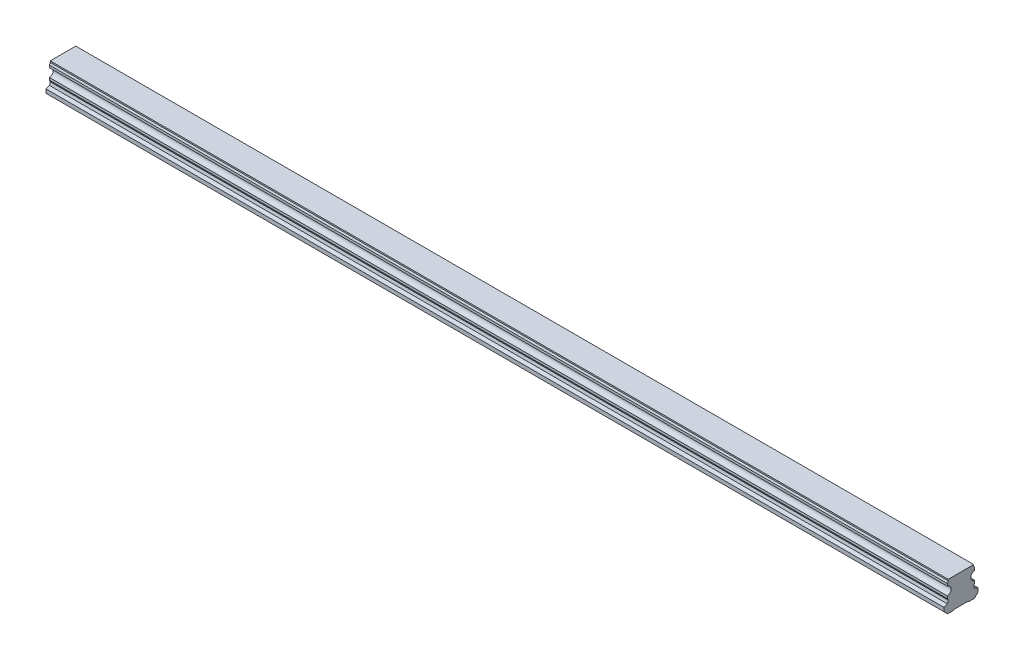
from build123d import *

# Parameters (mm, degrees)
BOSS_EXTRUDE1_DEPTH        = 660
SKETCH3_R                  = 3
SKETCH3_R_2                = 2.5
CUT_EXTRUDE3_DEPTH         = 12
SKETCH3_2_R                = 2.5
CUT_EXTRUDE4_DEPTH         = 15
CHAMFER1_SIZE              = 0.5
LPATTERN4_COUNT            = 11
LPATTERN4_PITCH            = 60
CHAMFER1_OF_LPATTERN4_SIZE = 0.5


with BuildPart() as part:
    # Sketch1 → Boss-Extrude1 (new body)
    with BuildSketch(Plane(origin=(0, 0, 0), x_dir=(0, 0, -1), z_dir=(1, 0, 0))):
        with BuildLine():
            Line((9.375, 21.8), (-9.375, 21.8))
            Line((-9.375, 21.8), (-9.375, 20.756))
            Line((-9.375, 20.756), (-10, 19.415683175))
            Line((-10, 19.415683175), (-10, 17.685449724))
            ThreePointArc((-10, 17.685449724), (-7.2, 14.6), (-10, 11.514550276))
            Line((-10, 11.514550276), (-10, 9.784316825))
            Line((-10, 9.784316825), (-9.375, 8.444))
            Line((-9.375, 8.444), (-9.922688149, 6.4))
            Line((-9.922688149, 6.4), (-12.5, 5.489338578))
            Line((-12.5, 5.489338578), (-12.5, 2.65))
            Line((-12.5, 2.65), (-9.85, 0))
            Line((-9.85, 0), (-5.5, 0))
            Line((-5.5, 0), (-5, 0.5))
            Line((-5, 0.5), (5, 0.5))
            Line((5, 0.5), (5.5, 0))
            Line((5.5, 0), (9.85, 0))
            Line((9.85, 0), (12.5, 2.65))
            Line((12.5, 2.65), (12.5, 5.489338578))
            Line((12.5, 5.489338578), (9.922688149, 6.4))
            Line((9.922688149, 6.4), (9.375, 8.444))
            Line((9.375, 8.444), (10, 9.784316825))
            Line((10, 9.784316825), (10, 11.514550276))
            ThreePointArc((10, 11.514550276), (7.2, 14.6), (10, 17.685449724))
            Line((10, 17.685449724), (10, 19.415683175))
            Line((10, 19.415683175), (9.375, 20.756))
            Line((9.375, 20.756), (9.375, 21.8))
        make_face()
    extrude(amount=BOSS_EXTRUDE1_DEPTH)

    # Sketch3 → Cut-Extrude3 (cut)
    with BuildSketch(Plane.XZ):
        with Locations(Location((30, 0, 0), (0, 0, 270))):
            Circle(SKETCH3_R)
        with Locations(Location((30, 0, 0), (0, 0, 270))):
            Circle(SKETCH3_R_2, mode=Mode.SUBTRACT)
    cut_extrude3 = extrude(amount=-CUT_EXTRUDE3_DEPTH, mode=Mode.SUBTRACT)

    # Sketch3_2 → Cut-Extrude4 (cut)
    with BuildSketch(Plane.XZ):
        with Locations(Location((30, 0, 0), (0, 0, 270))):
            Circle(SKETCH3_2_R)
    cut_extrude4 = extrude(amount=-CUT_EXTRUDE4_DEPTH, mode=Mode.SUBTRACT)

    # Cut-Extrude5 cone 1 section (on through the dimple's axis) → Cut-Extrude5 (revolve, cut)
    with BuildSketch(Plane(origin=(30, 15, 0), x_dir=(0, 0, -1), z_dir=(1, 0, 0))):
        Polygon((0, 0), (2.5, 0), (0, 1.443375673), align=None)
    cut_extrude5 = revolve(axis=Axis((30, 15, 0), (0, 1, 0)), mode=Mode.SUBTRACT)

    # Chamfer1
    chamfer1_edges = [part.edges().sort_by_distance(p)[0] for p in [
        (30, 0.5, 3),
    ]]
    chamfer(chamfer1_edges, length=CHAMFER1_SIZE)

    # LPattern4: Cut-Extrude3, Cut-Extrude4, Cut-Extrude5 ×11
    with Locations(*[(i * LPATTERN4_PITCH, 0, 0) for i in range(1, LPATTERN4_COUNT)]):
        add(cut_extrude3, mode=Mode.SUBTRACT)
        add(cut_extrude4, mode=Mode.SUBTRACT)
        add(cut_extrude5, mode=Mode.SUBTRACT)

    # Chamfer1 of LPattern4
    chamfer1_of_lpattern4_edges = [part.edges().sort_by_distance(p)[0] for p in [
        (90, 0.5, 3),
        (150, 0.5, 3),
        (210, 0.5, 3),
        (270, 0.5, 3),
        (330, 0.5, 3),
        (390, 0.5, 3),
        (450, 0.5, 3),
        (510, 0.5, 3),
        (570, 0.5, 3),
        (630, 0.5, 3),
    ]]
    chamfer(chamfer1_of_lpattern4_edges, length=CHAMFER1_OF_LPATTERN4_SIZE)


solid = part.part
